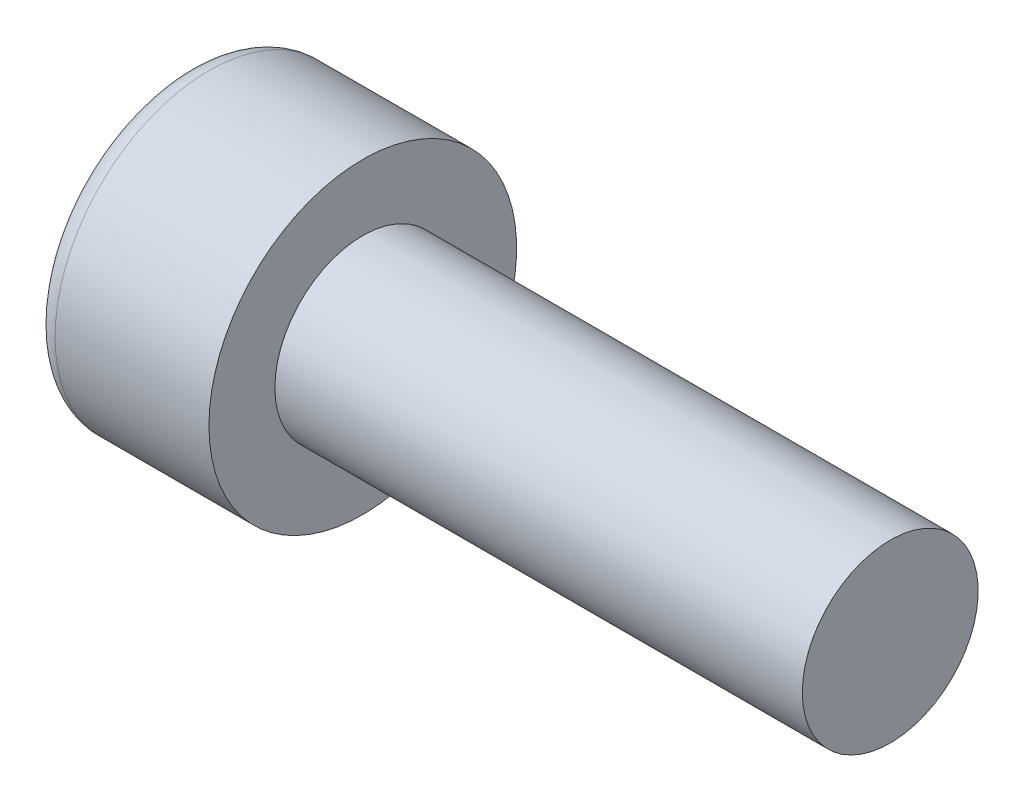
from build123d import *

# Parameters (mm, degrees)
VERRUNDUNG1_R                   = 0.5
SCHNITT_LINEAR_AUSTRAGEN1_DEPTH = 3


with BuildPart() as part:
    # Skizze1 → Rotation1 (revolve)
    with BuildSketch(Plane.XY, mode=Mode.PRIVATE) as rotation1_sk:
        Polygon((-16, 0), (-16, 3.5), (-12, 3.5), (-12, 2), (0, 2), (0, 0), align=None)
    revolve(rotation1_sk.sketch.rotate(Axis((-65.011808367, 0, 0), (1, 0, 0)), 90), axis=Axis((-65.011808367, 0, 0), (1, 0, 0)))

    # Verrundung1
    verrundung1_edges = [part.edges().sort_by_distance(p)[0] for p in [
        (-16, 0, -3.5),
    ]]
    fillet(verrundung1_edges, radius=VERRUNDUNG1_R)

    # Skizze2 → Schnitt-Linear austragen1 (cut)
    with BuildSketch(Plane.ZY.offset(16)):
        Polygon((1.5, 0.866025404), (0, 1.732050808), (-1.5, 0.866025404), (-1.5, -0.866025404), (0, -1.732050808), (1.5, -0.866025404), align=None)
    extrude(amount=-SCHNITT_LINEAR_AUSTRAGEN1_DEPTH, mode=Mode.SUBTRACT)


solid = part.part
